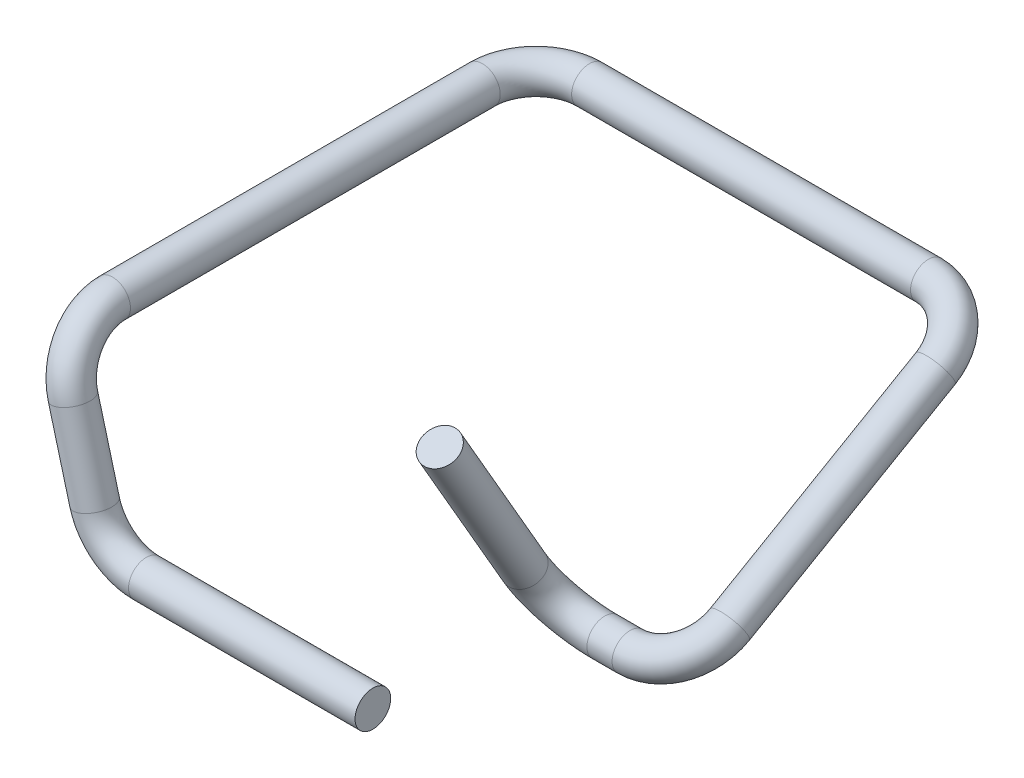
ISO-10303-21;
HEADER;
FILE_DESCRIPTION(('STEP AP214'),'2;1');
FILE_NAME('part.step','',(''),(''),'','','');
FILE_SCHEMA(('AUTOMOTIVE_DESIGN { 1 0 10303 214 1 1 1 1 }'));
ENDSEC;
DATA;
#1=APPLICATION_CONTEXT('core data for automotive mechanical design processes');
#2=APPLICATION_PROTOCOL_DEFINITION('international standard','automotive_design',2000,#1);
#3=PRODUCT_CONTEXT('',#1,'mechanical');
#4=PRODUCT('Part','Part','',(#3));
#5=PRODUCT_RELATED_PRODUCT_CATEGORY('part','',(#4));
#6=PRODUCT_DEFINITION_FORMATION('','',#4);
#7=PRODUCT_DEFINITION_CONTEXT('part definition',#1,'design');
#8=PRODUCT_DEFINITION('design','',#6,#7);
#9=PRODUCT_DEFINITION_SHAPE('','',#8);
#10=(LENGTH_UNIT() NAMED_UNIT(*) SI_UNIT(.MILLI.,.METRE.));
#11=(NAMED_UNIT(*) PLANE_ANGLE_UNIT() SI_UNIT($,.RADIAN.));
#12=(NAMED_UNIT(*) SI_UNIT($,.STERADIAN.) SOLID_ANGLE_UNIT());
#13=UNCERTAINTY_MEASURE_WITH_UNIT(LENGTH_MEASURE(1.E-05),#10,'distance_accuracy_value','');
#14=(GEOMETRIC_REPRESENTATION_CONTEXT(3) GLOBAL_UNCERTAINTY_ASSIGNED_CONTEXT((#13)) GLOBAL_UNIT_ASSIGNED_CONTEXT((#10,
#11,#12)) REPRESENTATION_CONTEXT('',''));
#15=CARTESIAN_POINT('',(0.,0.,0.));
#16=DIRECTION('',(0.,0.,1.));
#17=DIRECTION('',(1.,0.,0.));
#18=AXIS2_PLACEMENT_3D('',#15,#16,#17);
#19=CARTESIAN_POINT('',(-1.04083408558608E-13,25.9807621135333,-85.0000000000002));
#20=DIRECTION('',(0.,0.86602540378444,0.499999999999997));
#21=DIRECTION('',(0.,-0.499999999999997,0.86602540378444));
#22=AXIS2_PLACEMENT_3D('',#19,#20,#21);
#23=CYLINDRICAL_SURFACE('',#22,10.);
#24=CARTESIAN_POINT('',(-1.04083408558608E-13,25.9807621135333,-85.0000000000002));
#25=DIRECTION('',(0.,-0.86602540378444,-0.499999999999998));
#26=DIRECTION('',(-0.707106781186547,0.353553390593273,-0.612372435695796));
#27=AXIS2_PLACEMENT_3D('',#24,#25,#26);
#28=CIRCLE('',#27,10.);
#29=CARTESIAN_POINT('',(-10.0000000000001,25.9807621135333,-85.0000000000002));
#30=VERTEX_POINT('',#29);
#31=EDGE_CURVE('E32',#30,#30,#28,.T.);
#32=ORIENTED_EDGE('',*,*,#31,.F.);
#33=EDGE_LOOP('',(#32));
#34=FACE_BOUND('',#33,.T.);
#35=CARTESIAN_POINT('',(-1.14491749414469E-13,108.253175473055,-37.5000000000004));
#36=DIRECTION('',(0.,-0.86602540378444,-0.499999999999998));
#37=DIRECTION('',(-0.707106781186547,0.353553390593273,-0.612372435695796));
#38=AXIS2_PLACEMENT_3D('',#35,#36,#37);
#39=CIRCLE('',#38,10.);
#40=CARTESIAN_POINT('',(-7.07106781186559,111.788709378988,-43.6237243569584));
#41=VERTEX_POINT('',#40);
#42=EDGE_CURVE('E10',#41,#41,#39,.T.);
#43=ORIENTED_EDGE('',*,*,#42,.T.);
#44=EDGE_LOOP('',(#43));
#45=FACE_BOUND('',#44,.T.);
#46=ADVANCED_FACE('F26',(#34,#45),#23,.T.);
#47=CARTESIAN_POINT('',(30.,25.9807621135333,-85.0000000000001));
#48=DIRECTION('',(0.,0.499999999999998,-0.86602540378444));
#49=DIRECTION('',(0.,0.86602540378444,0.499999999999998));
#50=AXIS2_PLACEMENT_3D('',#47,#48,#49);
#51=TOROIDAL_SURFACE('',#50,30.0000000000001,10.);
#52=CARTESIAN_POINT('',(30.,0.,-100.));
#53=DIRECTION('',(1.,0.,0.));
#54=DIRECTION('',(0.,-0.258819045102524,-0.965925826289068));
#55=AXIS2_PLACEMENT_3D('',#52,#53,#54);
#56=CIRCLE('',#55,10.);
#57=CARTESIAN_POINT('',(30.,-8.66025403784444,-105.));
#58=VERTEX_POINT('',#57);
#59=EDGE_CURVE('E36',#58,#58,#56,.T.);
#60=CARTESIAN_POINT('',(30.,25.9807621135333,-85.0000000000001));
#61=DIRECTION('',(0.,0.499999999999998,-0.86602540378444));
#62=DIRECTION('',(0.,0.86602540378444,0.499999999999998));
#63=AXIS2_PLACEMENT_3D('',#60,#61,#62);
#64=CIRCLE('',#63,40.0000000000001);
#65=EDGE_CURVE('',#58,#30,#64,.T.);
#66=ORIENTED_EDGE('',*,*,#59,.F.);
#67=ORIENTED_EDGE('',*,*,#31,.T.);
#68=ORIENTED_EDGE('',*,*,#65,.T.);
#69=ORIENTED_EDGE('',*,*,#65,.F.);
#70=EDGE_LOOP('',(#66,#68,#67,#69));
#71=FACE_BOUND('',#70,.T.);
#72=ADVANCED_FACE('F94',(#71),#51,.T.);
#73=CARTESIAN_POINT('',(44.1180954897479,0.,-100.));
#74=DIRECTION('',(-1.,0.,0.));
#75=DIRECTION('',(0.,-1.,0.));
#76=AXIS2_PLACEMENT_3D('',#73,#74,#75);
#77=CYLINDRICAL_SURFACE('',#76,10.);
#78=CARTESIAN_POINT('',(44.1180954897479,0.,-100.));
#79=DIRECTION('',(1.,0.,0.));
#80=DIRECTION('',(0.,-0.258819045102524,-0.965925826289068));
#81=AXIS2_PLACEMENT_3D('',#78,#79,#80);
#82=CIRCLE('',#81,10.);
#83=CARTESIAN_POINT('',(44.1180954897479,-5.00000000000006,-91.3397459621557));
#84=VERTEX_POINT('',#83);
#85=EDGE_CURVE('E40',#84,#84,#82,.T.);
#86=ORIENTED_EDGE('',*,*,#85,.F.);
#87=EDGE_LOOP('',(#86));
#88=FACE_BOUND('',#87,.T.);
#89=ORIENTED_EDGE('',*,*,#59,.T.);
#90=EDGE_LOOP('',(#89));
#91=FACE_BOUND('',#90,.T.);
#92=ADVANCED_FACE('F99',(#88,#91),#77,.T.);
#93=CARTESIAN_POINT('',(44.1180954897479,14.9999999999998,-125.980762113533));
#94=DIRECTION('',(0.,-0.866025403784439,-0.499999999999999));
#95=DIRECTION('',(0.,0.499999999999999,-0.866025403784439));
#96=AXIS2_PLACEMENT_3D('',#93,#94,#95);
#97=TOROIDAL_SURFACE('',#96,29.9999999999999,10.);
#98=CARTESIAN_POINT('',(74.1180954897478,14.9999999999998,-125.980762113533));
#99=DIRECTION('',(0.,0.499999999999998,-0.86602540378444));
#100=DIRECTION('',(-0.707106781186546,-0.612372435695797,-0.353553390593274));
#101=AXIS2_PLACEMENT_3D('',#98,#99,#100);
#102=CIRCLE('',#101,10.);
#103=CARTESIAN_POINT('',(84.1180954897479,14.9999999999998,-125.980762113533));
#104=VERTEX_POINT('',#103);
#105=EDGE_CURVE('E45',#104,#104,#102,.T.);
#106=CARTESIAN_POINT('',(44.1180954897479,14.9999999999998,-125.980762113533));
#107=DIRECTION('',(0.,-0.866025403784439,-0.499999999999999));
#108=DIRECTION('',(0.,0.499999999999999,-0.866025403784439));
#109=AXIS2_PLACEMENT_3D('',#106,#107,#108);
#110=CIRCLE('',#109,39.9999999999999);
#111=EDGE_CURVE('',#104,#84,#110,.T.);
#112=ORIENTED_EDGE('',*,*,#105,.F.);
#113=ORIENTED_EDGE('',*,*,#85,.T.);
#114=ORIENTED_EDGE('',*,*,#111,.T.);
#115=ORIENTED_EDGE('',*,*,#111,.F.);
#116=EDGE_LOOP('',(#112,#114,#113,#115));
#117=FACE_BOUND('',#116,.T.);
#118=ADVANCED_FACE('F104',(#117),#97,.T.);
#119=CARTESIAN_POINT('',(74.1180954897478,81.5925826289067,-241.322498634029));
#120=DIRECTION('',(0.,-0.499999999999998,0.86602540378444));
#121=DIRECTION('',(0.,-0.86602540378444,-0.499999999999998));
#122=AXIS2_PLACEMENT_3D('',#119,#120,#121);
#123=CYLINDRICAL_SURFACE('',#122,10.);
#124=CARTESIAN_POINT('',(74.1180954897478,81.5925826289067,-241.322498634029));
#125=DIRECTION('',(0.,0.499999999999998,-0.86602540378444));
#126=DIRECTION('',(-0.707106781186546,-0.612372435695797,-0.353553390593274));
#127=AXIS2_PLACEMENT_3D('',#124,#125,#126);
#128=CIRCLE('',#127,10.);
#129=CARTESIAN_POINT('',(84.1180954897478,81.5925826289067,-241.322498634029));
#130=VERTEX_POINT('',#129);
#131=EDGE_CURVE('E48',#130,#130,#128,.T.);
#132=ORIENTED_EDGE('',*,*,#131,.F.);
#133=EDGE_LOOP('',(#132));
#134=FACE_BOUND('',#133,.T.);
#135=ORIENTED_EDGE('',*,*,#105,.T.);
#136=EDGE_LOOP('',(#135));
#137=FACE_BOUND('',#136,.T.);
#138=ADVANCED_FACE('F111',(#134,#137),#123,.T.);
#139=CARTESIAN_POINT('',(44.1180954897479,81.5925826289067,-241.322498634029));
#140=DIRECTION('',(0.,-0.86602540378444,-0.499999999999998));
#141=DIRECTION('',(0.,0.499999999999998,-0.86602540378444));
#142=AXIS2_PLACEMENT_3D('',#139,#140,#141);
#143=TOROIDAL_SURFACE('',#142,29.9999999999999,10.);
#144=CARTESIAN_POINT('',(44.1180954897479,96.5925826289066,-267.303260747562));
#145=DIRECTION('',(-1.,0.,0.));
#146=DIRECTION('',(0.,-0.965925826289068,0.258819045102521));
#147=AXIS2_PLACEMENT_3D('',#144,#145,#146);
#148=CIRCLE('',#147,10.);
#149=CARTESIAN_POINT('',(44.1180954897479,101.592582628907,-275.963514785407));
#150=VERTEX_POINT('',#149);
#151=EDGE_CURVE('E51',#150,#150,#148,.T.);
#152=CARTESIAN_POINT('',(44.1180954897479,81.5925826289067,-241.322498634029));
#153=DIRECTION('',(0.,-0.86602540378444,-0.499999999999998));
#154=DIRECTION('',(0.,0.499999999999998,-0.86602540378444));
#155=AXIS2_PLACEMENT_3D('',#152,#153,#154);
#156=CIRCLE('',#155,39.9999999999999);
#157=EDGE_CURVE('',#150,#130,#156,.T.);
#158=ORIENTED_EDGE('',*,*,#151,.F.);
#159=ORIENTED_EDGE('',*,*,#131,.T.);
#160=ORIENTED_EDGE('',*,*,#157,.T.);
#161=ORIENTED_EDGE('',*,*,#157,.F.);
#162=EDGE_LOOP('',(#158,#160,#159,#161));
#163=FACE_BOUND('',#162,.T.);
#164=ADVANCED_FACE('F115',(#163),#143,.T.);
#165=CARTESIAN_POINT('',(-145.881904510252,96.5925826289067,-267.303260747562));
#166=DIRECTION('',(1.,0.,0.));
#167=DIRECTION('',(0.,0.,-1.));
#168=AXIS2_PLACEMENT_3D('',#165,#166,#167);
#169=CYLINDRICAL_SURFACE('',#168,10.);
#170=CARTESIAN_POINT('',(-145.881904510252,96.5925826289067,-267.303260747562));
#171=DIRECTION('',(-1.,0.,0.));
#172=DIRECTION('',(0.,-0.965925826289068,0.258819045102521));
#173=AXIS2_PLACEMENT_3D('',#170,#171,#172);
#174=CIRCLE('',#173,10.);
#175=CARTESIAN_POINT('',(-145.881904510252,96.5925826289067,-277.303260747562));
#176=VERTEX_POINT('',#175);
#177=EDGE_CURVE('E54',#176,#176,#174,.T.);
#178=ORIENTED_EDGE('',*,*,#177,.F.);
#179=EDGE_LOOP('',(#178));
#180=FACE_BOUND('',#179,.T.);
#181=ORIENTED_EDGE('',*,*,#151,.T.);
#182=EDGE_LOOP('',(#181));
#183=FACE_BOUND('',#182,.T.);
#184=ADVANCED_FACE('F119',(#180,#183),#169,.T.);
#185=CARTESIAN_POINT('',(-145.881904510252,96.5925826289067,-237.303260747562));
#186=DIRECTION('',(0.,-1.,0.));
#187=DIRECTION('',(0.,0.,-1.));
#188=AXIS2_PLACEMENT_3D('',#185,#186,#187);
#189=TOROIDAL_SURFACE('',#188,30.,10.);
#190=CARTESIAN_POINT('',(-175.881904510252,96.5925826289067,-237.303260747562));
#191=DIRECTION('',(0.,0.,1.));
#192=DIRECTION('',(0.258819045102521,-0.965925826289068,0.));
#193=AXIS2_PLACEMENT_3D('',#190,#191,#192);
#194=CIRCLE('',#193,10.);
#195=CARTESIAN_POINT('',(-185.881904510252,96.5925826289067,-237.303260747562));
#196=VERTEX_POINT('',#195);
#197=EDGE_CURVE('E57',#196,#196,#194,.T.);
#198=CARTESIAN_POINT('',(-145.881904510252,96.5925826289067,-237.303260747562));
#199=DIRECTION('',(0.,-1.,0.));
#200=DIRECTION('',(0.,0.,-1.));
#201=AXIS2_PLACEMENT_3D('',#198,#199,#200);
#202=CIRCLE('',#201,40.);
#203=EDGE_CURVE('',#196,#176,#202,.T.);
#204=ORIENTED_EDGE('',*,*,#197,.F.);
#205=ORIENTED_EDGE('',*,*,#177,.T.);
#206=ORIENTED_EDGE('',*,*,#203,.T.);
#207=ORIENTED_EDGE('',*,*,#203,.F.);
#208=EDGE_LOOP('',(#204,#206,#205,#207));
#209=FACE_BOUND('',#208,.T.);
#210=ADVANCED_FACE('F123',(#209),#189,.T.);
#211=CARTESIAN_POINT('',(-175.881904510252,96.5925826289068,-30.));
#212=DIRECTION('',(0.,0.,-1.));
#213=DIRECTION('',(0.,1.,0.));
#214=AXIS2_PLACEMENT_3D('',#211,#212,#213);
#215=CYLINDRICAL_SURFACE('',#214,10.);
#216=CARTESIAN_POINT('',(-175.881904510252,96.5925826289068,-30.));
#217=DIRECTION('',(0.,0.,1.));
#218=DIRECTION('',(0.258819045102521,-0.965925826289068,0.));
#219=AXIS2_PLACEMENT_3D('',#216,#217,#218);
#220=CIRCLE('',#219,10.);
#221=CARTESIAN_POINT('',(-178.470094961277,106.251840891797,-30.));
#222=VERTEX_POINT('',#221);
#223=EDGE_CURVE('E60',#222,#222,#220,.T.);
#224=ORIENTED_EDGE('',*,*,#223,.F.);
#225=EDGE_LOOP('',(#224));
#226=FACE_BOUND('',#225,.T.);
#227=ORIENTED_EDGE('',*,*,#197,.T.);
#228=EDGE_LOOP('',(#227));
#229=FACE_BOUND('',#228,.T.);
#230=ADVANCED_FACE('F127',(#226,#229),#215,.T.);
#231=CARTESIAN_POINT('',(-168.117333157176,67.6148078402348,-30.));
#232=DIRECTION('',(-0.965925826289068,-0.25881904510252,0.));
#233=DIRECTION('',(0.25881904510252,-0.965925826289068,0.));
#234=AXIS2_PLACEMENT_3D('',#231,#232,#233);
#235=TOROIDAL_SURFACE('',#234,30.,10.);
#236=CARTESIAN_POINT('',(-168.117333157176,67.6148078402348,0.));
#237=DIRECTION('',(0.258819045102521,-0.965925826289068,0.));
#238=DIRECTION('',(0.,0.,-1.));
#239=AXIS2_PLACEMENT_3D('',#236,#237,#238);
#240=CIRCLE('',#239,10.);
#241=CARTESIAN_POINT('',(-168.117333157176,67.6148078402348,9.99999999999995));
#242=VERTEX_POINT('',#241);
#243=EDGE_CURVE('E63',#242,#242,#240,.T.);
#244=CARTESIAN_POINT('',(-168.117333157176,67.6148078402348,-30.));
#245=DIRECTION('',(-0.965925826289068,-0.25881904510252,0.));
#246=DIRECTION('',(0.25881904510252,-0.965925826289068,0.));
#247=AXIS2_PLACEMENT_3D('',#244,#245,#246);
#248=CIRCLE('',#247,40.);
#249=EDGE_CURVE('',#242,#222,#248,.T.);
#250=ORIENTED_EDGE('',*,*,#243,.F.);
#251=ORIENTED_EDGE('',*,*,#223,.T.);
#252=ORIENTED_EDGE('',*,*,#249,.T.);
#253=ORIENTED_EDGE('',*,*,#249,.F.);
#254=EDGE_LOOP('',(#250,#252,#251,#253));
#255=FACE_BOUND('',#254,.T.);
#256=ADVANCED_FACE('F131',(#255),#235,.T.);
#257=CARTESIAN_POINT('',(-155.957965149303,22.2354286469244,0.));
#258=DIRECTION('',(-0.258819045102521,0.965925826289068,0.));
#259=DIRECTION('',(-0.965925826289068,-0.258819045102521,0.));
#260=AXIS2_PLACEMENT_3D('',#257,#258,#259);
#261=CYLINDRICAL_SURFACE('',#260,10.);
#262=CARTESIAN_POINT('',(-155.957965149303,22.2354286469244,0.));
#263=DIRECTION('',(0.258819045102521,-0.965925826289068,0.));
#264=DIRECTION('',(0.,0.,-1.));
#265=AXIS2_PLACEMENT_3D('',#262,#263,#264);
#266=CIRCLE('',#265,10.);
#267=CARTESIAN_POINT('',(-165.617223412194,19.6472381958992,0.));
#268=VERTEX_POINT('',#267);
#269=EDGE_CURVE('E66',#268,#268,#266,.T.);
#270=ORIENTED_EDGE('',*,*,#269,.F.);
#271=EDGE_LOOP('',(#270));
#272=FACE_BOUND('',#271,.T.);
#273=ORIENTED_EDGE('',*,*,#243,.T.);
#274=EDGE_LOOP('',(#273));
#275=FACE_BOUND('',#274,.T.);
#276=ADVANCED_FACE('F90',(#272,#275),#261,.T.);
#277=CARTESIAN_POINT('',(-126.980190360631,30.,0.));
#278=DIRECTION('',(0.,0.,-1.));
#279=DIRECTION('',(0.,1.,0.));
#280=AXIS2_PLACEMENT_3D('',#277,#278,#279);
#281=TOROIDAL_SURFACE('',#280,30.,10.);
#282=CARTESIAN_POINT('',(-126.980190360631,0.,0.));
#283=DIRECTION('',(1.,0.,0.));
#284=DIRECTION('',(0.,0.,-1.));
#285=AXIS2_PLACEMENT_3D('',#282,#283,#284);
#286=CIRCLE('',#285,10.);
#287=CARTESIAN_POINT('',(-126.980190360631,-10.,0.));
#288=VERTEX_POINT('',#287);
#289=EDGE_CURVE('E69',#288,#288,#286,.T.);
#290=CARTESIAN_POINT('',(-126.980190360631,30.,0.));
#291=DIRECTION('',(0.,0.,-1.));
#292=DIRECTION('',(0.,1.,0.));
#293=AXIS2_PLACEMENT_3D('',#290,#291,#292);
#294=CIRCLE('',#293,40.);
#295=EDGE_CURVE('',#288,#268,#294,.T.);
#296=ORIENTED_EDGE('',*,*,#289,.F.);
#297=ORIENTED_EDGE('',*,*,#269,.T.);
#298=ORIENTED_EDGE('',*,*,#295,.T.);
#299=ORIENTED_EDGE('',*,*,#295,.F.);
#300=EDGE_LOOP('',(#296,#298,#297,#299));
#301=FACE_BOUND('',#300,.T.);
#302=ADVANCED_FACE('F81',(#301),#281,.T.);
#303=CARTESIAN_POINT('',(-126.980190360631,0.,0.));
#304=DIRECTION('',(1.,0.,0.));
#305=DIRECTION('',(0.,0.,-1.));
#306=AXIS2_PLACEMENT_3D('',#303,#304,#305);
#307=CYLINDRICAL_SURFACE('',#306,10.);
#308=ORIENTED_EDGE('',*,*,#289,.T.);
#309=EDGE_LOOP('',(#308));
#310=FACE_BOUND('',#309,.T.);
#311=CARTESIAN_POINT('',(0.,0.,0.));
#312=DIRECTION('',(1.,0.,0.));
#313=DIRECTION('',(0.,0.,-1.));
#314=AXIS2_PLACEMENT_3D('',#311,#312,#313);
#315=CIRCLE('',#314,10.);
#316=CARTESIAN_POINT('',(0.,0.,-10.));
#317=VERTEX_POINT('',#316);
#318=EDGE_CURVE('E72',#317,#317,#315,.T.);
#319=ORIENTED_EDGE('',*,*,#318,.F.);
#320=EDGE_LOOP('',(#319));
#321=FACE_BOUND('',#320,.T.);
#322=ADVANCED_FACE('F78',(#310,#321),#307,.T.);
#323=CARTESIAN_POINT('',(-1.14491749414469E-13,108.253175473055,-37.5000000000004));
#324=DIRECTION('',(0.,-0.86602540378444,-0.499999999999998));
#325=DIRECTION('',(-0.707106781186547,0.353553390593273,-0.612372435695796));
#326=AXIS2_PLACEMENT_3D('',#323,#324,#325);
#327=PLANE('',#326);
#328=ORIENTED_EDGE('',*,*,#42,.F.);
#329=EDGE_LOOP('',(#328));
#330=FACE_BOUND('',#329,.T.);
#331=ADVANCED_FACE('F80',(#330),#327,.F.);
#332=CARTESIAN_POINT('',(0.,0.,0.));
#333=DIRECTION('',(1.,0.,0.));
#334=DIRECTION('',(0.,0.,-1.));
#335=AXIS2_PLACEMENT_3D('',#332,#333,#334);
#336=PLANE('',#335);
#337=ORIENTED_EDGE('',*,*,#318,.T.);
#338=EDGE_LOOP('',(#337));
#339=FACE_BOUND('',#338,.T.);
#340=ADVANCED_FACE('F76',(#339),#336,.T.);
#341=CLOSED_SHELL('',(#46,#72,#92,#118,#138,#164,#184,#210,#230,#256,#276,#302,#322,#331,#340));
#342=MANIFOLD_SOLID_BREP('B2',#341);
#343=ADVANCED_BREP_SHAPE_REPRESENTATION('',(#18,#342),#14);
#344=SHAPE_DEFINITION_REPRESENTATION(#9,#343);
ENDSEC;
END-ISO-10303-21;
